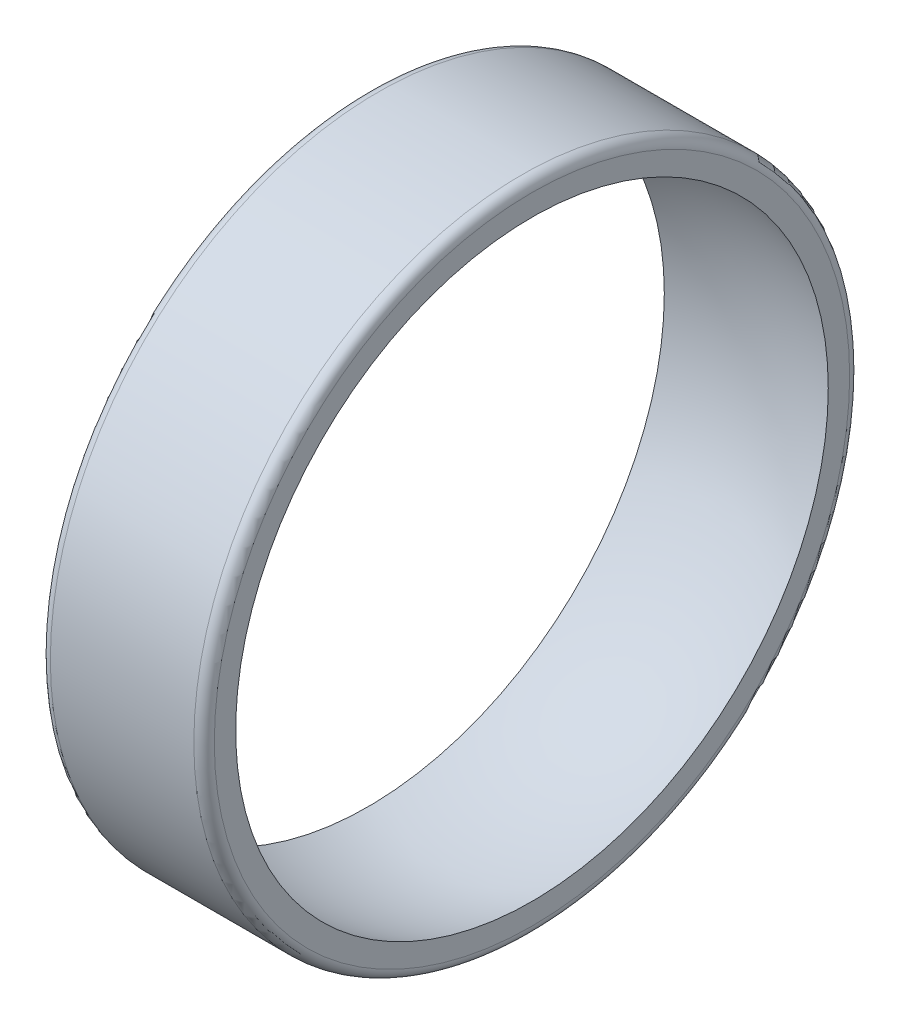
from build123d import *


with BuildPart() as part:
    # Esquisse1 → Base-R_volution (revolve)
    with BuildSketch(Plane(origin=(0, 0, 0), x_dir=(1, 0, 0), z_dir=(0, 1, 0)), mode=Mode.PRIVATE) as base_r_volution_sk:
        with BuildLine():
            Line((0, 72.284161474), (0, 77.5))
            ThreePointArc((0, 77.5), (0.732233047, 79.267766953), (2.5, 80))
            Line((2.5, 80), (37.5, 80))
            ThreePointArc((37.5, 80), (39.267766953, 79.267766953), (40, 77.5))
            Line((40, 77.5), (40, 72.284161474))
            ThreePointArc((40, 72.284161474), (20, 75), (0, 72.284161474))
        make_face()
    revolve(base_r_volution_sk.sketch.rotate(Axis((0, 0, 0), (1, 0, 0)), 180), axis=Axis((0, 0, 0), (1, 0, 0)))


solid = part.part
